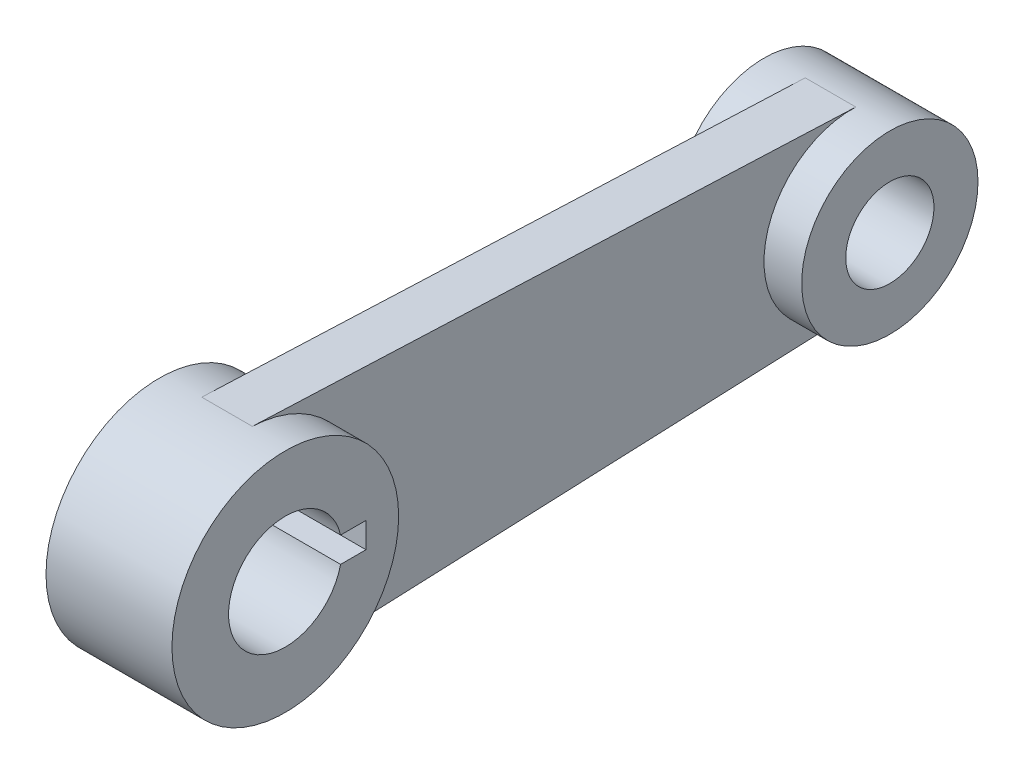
ISO-10303-21;
HEADER;
FILE_DESCRIPTION(('STEP AP214'),'2;1');
FILE_NAME('part.step','',(''),(''),'','','');
FILE_SCHEMA(('AUTOMOTIVE_DESIGN { 1 0 10303 214 1 1 1 1 }'));
ENDSEC;
DATA;
#1=APPLICATION_CONTEXT('core data for automotive mechanical design processes');
#2=APPLICATION_PROTOCOL_DEFINITION('international standard','automotive_design',2000,#1);
#3=PRODUCT_CONTEXT('',#1,'mechanical');
#4=PRODUCT('Part','Part','',(#3));
#5=PRODUCT_RELATED_PRODUCT_CATEGORY('part','',(#4));
#6=PRODUCT_DEFINITION_FORMATION('','',#4);
#7=PRODUCT_DEFINITION_CONTEXT('part definition',#1,'design');
#8=PRODUCT_DEFINITION('design','',#6,#7);
#9=PRODUCT_DEFINITION_SHAPE('','',#8);
#10=(LENGTH_UNIT() NAMED_UNIT(*) SI_UNIT(.MILLI.,.METRE.));
#11=(NAMED_UNIT(*) PLANE_ANGLE_UNIT() SI_UNIT($,.RADIAN.));
#12=(NAMED_UNIT(*) SI_UNIT($,.STERADIAN.) SOLID_ANGLE_UNIT());
#13=UNCERTAINTY_MEASURE_WITH_UNIT(LENGTH_MEASURE(1.E-05),#10,'distance_accuracy_value','');
#14=(GEOMETRIC_REPRESENTATION_CONTEXT(3) GLOBAL_UNCERTAINTY_ASSIGNED_CONTEXT((#13)) GLOBAL_UNIT_ASSIGNED_CONTEXT((#10,
#11,#12)) REPRESENTATION_CONTEXT('',''));
#15=CARTESIAN_POINT('',(0.,0.,0.));
#16=DIRECTION('',(0.,0.,1.));
#17=DIRECTION('',(1.,0.,0.));
#18=AXIS2_PLACEMENT_3D('',#15,#16,#17);
#19=CARTESIAN_POINT('',(7.9375,0.,0.));
#20=DIRECTION('',(-1.,0.,0.));
#21=DIRECTION('',(0.,0.,1.));
#22=AXIS2_PLACEMENT_3D('',#19,#20,#21);
#23=CYLINDRICAL_SURFACE('',#22,14.2875);
#24=CARTESIAN_POINT('',(7.9375,0.,0.));
#25=DIRECTION('',(1.,0.,0.));
#26=DIRECTION('',(0.,0.,-1.));
#27=AXIS2_PLACEMENT_3D('',#24,#25,#26);
#28=CIRCLE('',#27,14.2875);
#29=CARTESIAN_POINT('',(7.9375,0.,-14.2875));
#30=VERTEX_POINT('',#29);
#31=EDGE_CURVE('E159',#30,#30,#28,.T.);
#32=ORIENTED_EDGE('',*,*,#31,.F.);
#33=EDGE_LOOP('',(#32));
#34=FACE_BOUND('',#33,.T.);
#35=CARTESIAN_POINT('',(-7.9375,0.,0.));
#36=DIRECTION('',(1.,0.,0.));
#37=DIRECTION('',(0.,0.,-1.));
#38=AXIS2_PLACEMENT_3D('',#35,#36,#37);
#39=CIRCLE('',#38,14.2875);
#40=CARTESIAN_POINT('',(-7.9375,0.,-14.2875));
#41=VERTEX_POINT('',#40);
#42=EDGE_CURVE('E140',#41,#41,#39,.T.);
#43=ORIENTED_EDGE('',*,*,#42,.T.);
#44=EDGE_LOOP('',(#43));
#45=FACE_BOUND('',#44,.T.);
#46=CARTESIAN_POINT('',(-3.1877,0.,0.));
#47=DIRECTION('',(1.,0.,0.));
#48=DIRECTION('',(0.,0.,-1.));
#49=AXIS2_PLACEMENT_3D('',#46,#47,#48);
#50=CIRCLE('',#49,14.2875);
#51=CARTESIAN_POINT('',(-3.18770000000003,-14.2750922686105,-0.5953125));
#52=VERTEX_POINT('',#51);
#53=CARTESIAN_POINT('',(-3.1877,14.2750922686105,-0.595312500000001));
#54=VERTEX_POINT('',#53);
#55=EDGE_CURVE('E112',#52,#54,#50,.T.);
#56=ORIENTED_EDGE('',*,*,#55,.F.);
#57=DIRECTION('',(-1.,0.,0.));
#58=VECTOR('',#57,1.);
#59=CARTESIAN_POINT('',(89.1865571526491,-14.2750922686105,-0.5953125));
#60=LINE('',#59,#58);
#61=CARTESIAN_POINT('',(3.18770000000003,-14.2750922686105,-0.5953125));
#62=VERTEX_POINT('',#61);
#63=EDGE_CURVE('E97',#62,#52,#60,.T.);
#64=ORIENTED_EDGE('',*,*,#63,.F.);
#65=CARTESIAN_POINT('',(3.1877,0.,0.));
#66=DIRECTION('',(1.,0.,0.));
#67=DIRECTION('',(0.,0.,-1.));
#68=AXIS2_PLACEMENT_3D('',#65,#66,#67);
#69=CIRCLE('',#68,14.2875);
#70=CARTESIAN_POINT('',(3.1877,14.2750922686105,-0.595312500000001));
#71=VERTEX_POINT('',#70);
#72=EDGE_CURVE('E134',#62,#71,#69,.T.);
#73=ORIENTED_EDGE('',*,*,#72,.T.);
#74=DIRECTION('',(-1.,0.,0.));
#75=VECTOR('',#74,1.);
#76=CARTESIAN_POINT('',(89.1865571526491,14.2750922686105,-0.5953125));
#77=LINE('',#76,#75);
#78=EDGE_CURVE('E117',#71,#54,#77,.T.);
#79=ORIENTED_EDGE('',*,*,#78,.T.);
#80=EDGE_LOOP('',(#56,#64,#73,#79));
#81=FACE_BOUND('',#80,.T.);
#82=ADVANCED_FACE('F32',(#34,#45,#81),#23,.T.);
#83=CARTESIAN_POINT('',(7.9375,0.,0.));
#84=DIRECTION('',(-1.,0.,0.));
#85=DIRECTION('',(0.,0.,1.));
#86=AXIS2_PLACEMENT_3D('',#83,#84,#85);
#87=CYLINDRICAL_SURFACE('',#86,7.1501);
#88=CARTESIAN_POINT('',(-7.9375,0.,0.));
#89=DIRECTION('',(1.,0.,0.));
#90=DIRECTION('',(0.,0.,-1.));
#91=AXIS2_PLACEMENT_3D('',#88,#89,#90);
#92=CIRCLE('',#91,7.1501);
#93=CARTESIAN_POINT('',(-7.9375,1.6002,-6.96873661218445));
#94=VERTEX_POINT('',#93);
#95=CARTESIAN_POINT('',(-7.9375,-1.6002,-6.96873661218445));
#96=VERTEX_POINT('',#95);
#97=EDGE_CURVE('E147',#94,#96,#92,.T.);
#98=ORIENTED_EDGE('',*,*,#97,.F.);
#99=DIRECTION('',(-1.,0.,0.));
#100=VECTOR('',#99,1.);
#101=CARTESIAN_POINT('',(7.9375,1.6002,-6.96873661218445));
#102=LINE('',#101,#100);
#103=CARTESIAN_POINT('',(7.9375,1.6002,-6.96873661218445));
#104=VERTEX_POINT('',#103);
#105=EDGE_CURVE('E12',#104,#94,#102,.T.);
#106=ORIENTED_EDGE('',*,*,#105,.F.);
#107=CARTESIAN_POINT('',(7.9375,0.,0.));
#108=DIRECTION('',(1.,0.,0.));
#109=DIRECTION('',(0.,0.,-1.));
#110=AXIS2_PLACEMENT_3D('',#107,#108,#109);
#111=CIRCLE('',#110,7.1501);
#112=CARTESIAN_POINT('',(7.9375,-1.6002,-6.96873661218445));
#113=VERTEX_POINT('',#112);
#114=EDGE_CURVE('E162',#104,#113,#111,.T.);
#115=ORIENTED_EDGE('',*,*,#114,.T.);
#116=DIRECTION('',(-1.,0.,0.));
#117=VECTOR('',#116,1.);
#118=CARTESIAN_POINT('',(7.9375,-1.6002,-6.96873661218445));
#119=LINE('',#118,#117);
#120=EDGE_CURVE('E173',#113,#96,#119,.T.);
#121=ORIENTED_EDGE('',*,*,#120,.T.);
#122=EDGE_LOOP('',(#98,#106,#115,#121));
#123=FACE_BOUND('',#122,.T.);
#124=ADVANCED_FACE('F190',(#123),#87,.F.);
#125=CARTESIAN_POINT('',(7.9375,1.6002,-118.746246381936));
#126=DIRECTION('',(0.,1.,0.));
#127=DIRECTION('',(0.,0.,1.));
#128=AXIS2_PLACEMENT_3D('',#125,#126,#127);
#129=PLANE('',#128);
#130=DIRECTION('',(0.,0.,-1.));
#131=VECTOR('',#130,1.);
#132=CARTESIAN_POINT('',(-7.9375,1.6002,-118.746246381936));
#133=LINE('',#132,#131);
#134=CARTESIAN_POINT('',(-7.9375,1.6002,-10.1691366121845));
#135=VERTEX_POINT('',#134);
#136=EDGE_CURVE('E150',#94,#135,#133,.T.);
#137=ORIENTED_EDGE('',*,*,#136,.T.);
#138=DIRECTION('',(-1.,0.,0.));
#139=VECTOR('',#138,1.);
#140=CARTESIAN_POINT('',(7.9375,1.6002,-10.1691366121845));
#141=LINE('',#140,#139);
#142=CARTESIAN_POINT('',(7.9375,1.6002,-10.1691366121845));
#143=VERTEX_POINT('',#142);
#144=EDGE_CURVE('E39',#143,#135,#141,.T.);
#145=ORIENTED_EDGE('',*,*,#144,.F.);
#146=DIRECTION('',(0.,0.,-1.));
#147=VECTOR('',#146,1.);
#148=CARTESIAN_POINT('',(7.9375,1.6002,-118.746246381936));
#149=LINE('',#148,#147);
#150=EDGE_CURVE('E165',#104,#143,#149,.T.);
#151=ORIENTED_EDGE('',*,*,#150,.F.);
#152=ORIENTED_EDGE('',*,*,#105,.T.);
#153=EDGE_LOOP('',(#137,#145,#151,#152));
#154=FACE_BOUND('',#153,.T.);
#155=ADVANCED_FACE('F184',(#154),#129,.F.);
#156=CARTESIAN_POINT('',(7.9375,0.,-10.1691366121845));
#157=DIRECTION('',(0.,0.,-1.));
#158=DIRECTION('',(-1.,0.,0.));
#159=AXIS2_PLACEMENT_3D('',#156,#157,#158);
#160=PLANE('',#159);
#161=DIRECTION('',(0.,-1.,0.));
#162=VECTOR('',#161,1.);
#163=CARTESIAN_POINT('',(-7.9375,0.,-10.1691366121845));
#164=LINE('',#163,#162);
#165=CARTESIAN_POINT('',(-7.9375,-1.6002,-10.1691366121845));
#166=VERTEX_POINT('',#165);
#167=EDGE_CURVE('E153',#135,#166,#164,.T.);
#168=ORIENTED_EDGE('',*,*,#167,.T.);
#169=DIRECTION('',(-1.,0.,0.));
#170=VECTOR('',#169,1.);
#171=CARTESIAN_POINT('',(7.9375,-1.6002,-10.1691366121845));
#172=LINE('',#171,#170);
#173=CARTESIAN_POINT('',(7.9375,-1.6002,-10.1691366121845));
#174=VERTEX_POINT('',#173);
#175=EDGE_CURVE('E175',#174,#166,#172,.T.);
#176=ORIENTED_EDGE('',*,*,#175,.F.);
#177=DIRECTION('',(0.,-1.,0.));
#178=VECTOR('',#177,1.);
#179=CARTESIAN_POINT('',(7.9375,0.,-10.1691366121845));
#180=LINE('',#179,#178);
#181=EDGE_CURVE('E168',#143,#174,#180,.T.);
#182=ORIENTED_EDGE('',*,*,#181,.F.);
#183=ORIENTED_EDGE('',*,*,#144,.T.);
#184=EDGE_LOOP('',(#168,#176,#182,#183));
#185=FACE_BOUND('',#184,.T.);
#186=ADVANCED_FACE('F179',(#185),#160,.F.);
#187=CARTESIAN_POINT('',(7.9375,-1.6002,-118.746246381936));
#188=DIRECTION('',(0.,1.,0.));
#189=DIRECTION('',(0.,0.,1.));
#190=AXIS2_PLACEMENT_3D('',#187,#188,#189);
#191=PLANE('',#190);
#192=DIRECTION('',(0.,0.,-1.));
#193=VECTOR('',#192,1.);
#194=CARTESIAN_POINT('',(-7.9375,-1.6002,-118.746246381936));
#195=LINE('',#194,#193);
#196=EDGE_CURVE('E156',#96,#166,#195,.T.);
#197=ORIENTED_EDGE('',*,*,#196,.F.);
#198=ORIENTED_EDGE('',*,*,#120,.F.);
#199=DIRECTION('',(0.,0.,-1.));
#200=VECTOR('',#199,1.);
#201=CARTESIAN_POINT('',(7.9375,-1.6002,-118.746246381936));
#202=LINE('',#201,#200);
#203=EDGE_CURVE('E170',#113,#174,#202,.T.);
#204=ORIENTED_EDGE('',*,*,#203,.T.);
#205=ORIENTED_EDGE('',*,*,#175,.T.);
#206=EDGE_LOOP('',(#197,#198,#204,#205));
#207=FACE_BOUND('',#206,.T.);
#208=ADVANCED_FACE('F194',(#207),#191,.T.);
#209=CARTESIAN_POINT('',(7.9375,0.,-118.746246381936));
#210=DIRECTION('',(1.,0.,0.));
#211=DIRECTION('',(0.,0.,-1.));
#212=AXIS2_PLACEMENT_3D('',#209,#210,#211);
#213=PLANE('',#212);
#214=ORIENTED_EDGE('',*,*,#31,.T.);
#215=EDGE_LOOP('',(#214));
#216=FACE_BOUND('',#215,.T.);
#217=ORIENTED_EDGE('',*,*,#114,.F.);
#218=ORIENTED_EDGE('',*,*,#150,.T.);
#219=ORIENTED_EDGE('',*,*,#181,.T.);
#220=ORIENTED_EDGE('',*,*,#203,.F.);
#221=EDGE_LOOP('',(#217,#218,#219,#220));
#222=FACE_BOUND('',#221,.T.);
#223=ADVANCED_FACE('F196',(#216,#222),#213,.T.);
#224=CARTESIAN_POINT('',(-7.9375,0.,-118.746246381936));
#225=DIRECTION('',(1.,0.,0.));
#226=DIRECTION('',(0.,0.,-1.));
#227=AXIS2_PLACEMENT_3D('',#224,#225,#226);
#228=PLANE('',#227);
#229=ORIENTED_EDGE('',*,*,#42,.F.);
#230=EDGE_LOOP('',(#229));
#231=FACE_BOUND('',#230,.T.);
#232=ORIENTED_EDGE('',*,*,#97,.T.);
#233=ORIENTED_EDGE('',*,*,#196,.T.);
#234=ORIENTED_EDGE('',*,*,#167,.F.);
#235=ORIENTED_EDGE('',*,*,#136,.F.);
#236=EDGE_LOOP('',(#232,#233,#234,#235));
#237=FACE_BOUND('',#236,.T.);
#238=ADVANCED_FACE('F187',(#231,#237),#228,.F.);
#239=CARTESIAN_POINT('',(89.1865571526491,-9.33162879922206,-119.13540220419));
#240=DIRECTION('',(0.,-0.999131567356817,-0.0416666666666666));
#241=DIRECTION('',(0.,0.0416666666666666,-0.999131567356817));
#242=AXIS2_PLACEMENT_3D('',#239,#240,#241);
#243=PLANE('',#242);
#244=DIRECTION('',(-1.,0.,0.));
#245=VECTOR('',#244,1.);
#246=CARTESIAN_POINT('',(89.1865571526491,-11.1028495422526,-76.6630208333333));
#247=LINE('',#246,#245);
#248=CARTESIAN_POINT('',(3.1877,-11.1028495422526,-76.6630208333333));
#249=VERTEX_POINT('',#248);
#250=CARTESIAN_POINT('',(-3.1877,-11.1028495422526,-76.6630208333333));
#251=VERTEX_POINT('',#250);
#252=EDGE_CURVE('E137',#249,#251,#247,.T.);
#253=ORIENTED_EDGE('',*,*,#252,.F.);
#254=DIRECTION('',(0.,-0.0416666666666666,0.999131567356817));
#255=VECTOR('',#254,1.);
#256=CARTESIAN_POINT('',(3.1877,-9.33162879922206,-119.13540220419));
#257=LINE('',#256,#255);
#258=EDGE_CURVE('E103',#249,#62,#257,.T.);
#259=ORIENTED_EDGE('',*,*,#258,.T.);
#260=ORIENTED_EDGE('',*,*,#63,.T.);
#261=DIRECTION('',(0.,-0.0416666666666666,0.999131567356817));
#262=VECTOR('',#261,1.);
#263=CARTESIAN_POINT('',(-3.1877,-9.33162879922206,-119.13540220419));
#264=LINE('',#263,#262);
#265=EDGE_CURVE('E101',#251,#52,#264,.T.);
#266=ORIENTED_EDGE('',*,*,#265,.F.);
#267=EDGE_LOOP('',(#253,#259,#260,#266));
#268=FACE_BOUND('',#267,.T.);
#269=ADVANCED_FACE('F100',(#268),#243,.T.);
#270=CARTESIAN_POINT('',(89.1865571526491,9.33162879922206,-119.13540220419));
#271=DIRECTION('',(0.,-0.999131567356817,0.0416666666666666));
#272=DIRECTION('',(0.,-0.0416666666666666,-0.999131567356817));
#273=AXIS2_PLACEMENT_3D('',#270,#271,#272);
#274=PLANE('',#273);
#275=DIRECTION('',(0.,0.0416666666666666,0.999131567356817));
#276=VECTOR('',#275,1.);
#277=CARTESIAN_POINT('',(3.1877,9.33162879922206,-119.13540220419));
#278=LINE('',#277,#276);
#279=CARTESIAN_POINT('',(3.18770000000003,11.1028495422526,-76.6630208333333));
#280=VERTEX_POINT('',#279);
#281=EDGE_CURVE('E53',#280,#71,#278,.T.);
#282=ORIENTED_EDGE('',*,*,#281,.F.);
#283=DIRECTION('',(-1.,0.,0.));
#284=VECTOR('',#283,1.);
#285=CARTESIAN_POINT('',(89.1865571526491,11.1028495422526,-76.6630208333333));
#286=LINE('',#285,#284);
#287=CARTESIAN_POINT('',(-3.1877,11.1028495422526,-76.6630208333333));
#288=VERTEX_POINT('',#287);
#289=EDGE_CURVE('E46',#280,#288,#286,.T.);
#290=ORIENTED_EDGE('',*,*,#289,.T.);
#291=DIRECTION('',(0.,0.0416666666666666,0.999131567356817));
#292=VECTOR('',#291,1.);
#293=CARTESIAN_POINT('',(-3.1877,9.33162879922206,-119.13540220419));
#294=LINE('',#293,#292);
#295=EDGE_CURVE('E115',#288,#54,#294,.T.);
#296=ORIENTED_EDGE('',*,*,#295,.T.);
#297=ORIENTED_EDGE('',*,*,#78,.F.);
#298=EDGE_LOOP('',(#282,#290,#296,#297));
#299=FACE_BOUND('',#298,.T.);
#300=ADVANCED_FACE('F252',(#299),#274,.F.);
#301=CARTESIAN_POINT('',(3.1877,0.,-118.746246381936));
#302=DIRECTION('',(1.,0.,0.));
#303=DIRECTION('',(0.,0.,-1.));
#304=AXIS2_PLACEMENT_3D('',#301,#302,#303);
#305=PLANE('',#304);
#306=ORIENTED_EDGE('',*,*,#72,.F.);
#307=ORIENTED_EDGE('',*,*,#258,.F.);
#308=CARTESIAN_POINT('',(3.1877,0.,-76.2));
#309=DIRECTION('',(1.,0.,0.));
#310=DIRECTION('',(0.,0.,-1.));
#311=AXIS2_PLACEMENT_3D('',#308,#309,#310);
#312=CIRCLE('',#311,11.1125);
#313=EDGE_CURVE('E107',#280,#249,#312,.T.);
#314=ORIENTED_EDGE('',*,*,#313,.F.);
#315=ORIENTED_EDGE('',*,*,#281,.T.);
#316=EDGE_LOOP('',(#306,#307,#314,#315));
#317=FACE_BOUND('',#316,.T.);
#318=ADVANCED_FACE('F246',(#317),#305,.T.);
#319=CARTESIAN_POINT('',(7.9375,0.,-76.2));
#320=DIRECTION('',(-1.,0.,0.));
#321=DIRECTION('',(0.,0.,1.));
#322=AXIS2_PLACEMENT_3D('',#319,#320,#321);
#323=CYLINDRICAL_SURFACE('',#322,11.1125);
#324=CARTESIAN_POINT('',(-7.9375,0.,-76.2));
#325=DIRECTION('',(1.,0.,0.));
#326=DIRECTION('',(0.,0.,-1.));
#327=AXIS2_PLACEMENT_3D('',#324,#325,#326);
#328=CIRCLE('',#327,11.1125);
#329=CARTESIAN_POINT('',(-7.9375,0.,-87.3125));
#330=VERTEX_POINT('',#329);
#331=EDGE_CURVE('E125',#330,#330,#328,.T.);
#332=ORIENTED_EDGE('',*,*,#331,.T.);
#333=EDGE_LOOP('',(#332));
#334=FACE_BOUND('',#333,.T.);
#335=CARTESIAN_POINT('',(7.9375,0.,-76.2));
#336=DIRECTION('',(1.,0.,0.));
#337=DIRECTION('',(0.,0.,-1.));
#338=AXIS2_PLACEMENT_3D('',#335,#336,#337);
#339=CIRCLE('',#338,11.1125);
#340=CARTESIAN_POINT('',(7.9375,0.,-87.3125));
#341=VERTEX_POINT('',#340);
#342=EDGE_CURVE('E131',#341,#341,#339,.T.);
#343=ORIENTED_EDGE('',*,*,#342,.F.);
#344=EDGE_LOOP('',(#343));
#345=FACE_BOUND('',#344,.T.);
#346=ORIENTED_EDGE('',*,*,#252,.T.);
#347=CARTESIAN_POINT('',(-3.1877,0.,-76.2));
#348=DIRECTION('',(1.,0.,0.));
#349=DIRECTION('',(0.,0.,-1.));
#350=AXIS2_PLACEMENT_3D('',#347,#348,#349);
#351=CIRCLE('',#350,11.1125);
#352=EDGE_CURVE('E114',#288,#251,#351,.T.);
#353=ORIENTED_EDGE('',*,*,#352,.F.);
#354=ORIENTED_EDGE('',*,*,#289,.F.);
#355=ORIENTED_EDGE('',*,*,#313,.T.);
#356=EDGE_LOOP('',(#346,#353,#354,#355));
#357=FACE_BOUND('',#356,.T.);
#358=ADVANCED_FACE('F251',(#334,#345,#357),#323,.T.);
#359=CARTESIAN_POINT('',(7.9375,0.,-76.2));
#360=DIRECTION('',(-1.,0.,0.));
#361=DIRECTION('',(0.,0.,1.));
#362=AXIS2_PLACEMENT_3D('',#359,#360,#361);
#363=CYLINDRICAL_SURFACE('',#362,5.5626);
#364=CARTESIAN_POINT('',(7.9375,0.,-76.2));
#365=DIRECTION('',(1.,0.,0.));
#366=DIRECTION('',(0.,0.,-1.));
#367=AXIS2_PLACEMENT_3D('',#364,#365,#366);
#368=CIRCLE('',#367,5.5626);
#369=CARTESIAN_POINT('',(7.9375,0.,-81.7626));
#370=VERTEX_POINT('',#369);
#371=EDGE_CURVE('E128',#370,#370,#368,.T.);
#372=ORIENTED_EDGE('',*,*,#371,.T.);
#373=EDGE_LOOP('',(#372));
#374=FACE_BOUND('',#373,.T.);
#375=CARTESIAN_POINT('',(-7.9375,0.,-76.2));
#376=DIRECTION('',(1.,0.,0.));
#377=DIRECTION('',(0.,0.,-1.));
#378=AXIS2_PLACEMENT_3D('',#375,#376,#377);
#379=CIRCLE('',#378,5.5626);
#380=CARTESIAN_POINT('',(-7.9375,0.,-81.7626));
#381=VERTEX_POINT('',#380);
#382=EDGE_CURVE('E122',#381,#381,#379,.T.);
#383=ORIENTED_EDGE('',*,*,#382,.F.);
#384=EDGE_LOOP('',(#383));
#385=FACE_BOUND('',#384,.T.);
#386=ADVANCED_FACE('F261',(#374,#385),#363,.F.);
#387=CARTESIAN_POINT('',(7.9375,0.,-118.746246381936));
#388=DIRECTION('',(1.,0.,0.));
#389=DIRECTION('',(0.,0.,-1.));
#390=AXIS2_PLACEMENT_3D('',#387,#388,#389);
#391=PLANE('',#390);
#392=ORIENTED_EDGE('',*,*,#371,.F.);
#393=EDGE_LOOP('',(#392));
#394=FACE_BOUND('',#393,.T.);
#395=ORIENTED_EDGE('',*,*,#342,.T.);
#396=EDGE_LOOP('',(#395));
#397=FACE_BOUND('',#396,.T.);
#398=ADVANCED_FACE('F266',(#394,#397),#391,.T.);
#399=CARTESIAN_POINT('',(-7.9375,0.,-118.746246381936));
#400=DIRECTION('',(1.,0.,0.));
#401=DIRECTION('',(0.,0.,-1.));
#402=AXIS2_PLACEMENT_3D('',#399,#400,#401);
#403=PLANE('',#402);
#404=ORIENTED_EDGE('',*,*,#382,.T.);
#405=EDGE_LOOP('',(#404));
#406=FACE_BOUND('',#405,.T.);
#407=ORIENTED_EDGE('',*,*,#331,.F.);
#408=EDGE_LOOP('',(#407));
#409=FACE_BOUND('',#408,.T.);
#410=ADVANCED_FACE('F276',(#406,#409),#403,.F.);
#411=CARTESIAN_POINT('',(-3.1877,0.,-118.746246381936));
#412=DIRECTION('',(-1.,0.,0.));
#413=DIRECTION('',(0.,0.,-1.));
#414=AXIS2_PLACEMENT_3D('',#411,#412,#413);
#415=PLANE('',#414);
#416=ORIENTED_EDGE('',*,*,#55,.T.);
#417=ORIENTED_EDGE('',*,*,#295,.F.);
#418=ORIENTED_EDGE('',*,*,#352,.T.);
#419=ORIENTED_EDGE('',*,*,#265,.T.);
#420=EDGE_LOOP('',(#416,#417,#418,#419));
#421=FACE_BOUND('',#420,.T.);
#422=ADVANCED_FACE('F111',(#421),#415,.T.);
#423=CLOSED_SHELL('',(#82,#124,#155,#186,#208,#223,#238,#269,#300,#318,#358,#386,#398,#410,#422));
#424=MANIFOLD_SOLID_BREP('B2',#423);
#425=ADVANCED_BREP_SHAPE_REPRESENTATION('',(#18,#424),#14);
#426=SHAPE_DEFINITION_REPRESENTATION(#9,#425);
ENDSEC;
END-ISO-10303-21;
